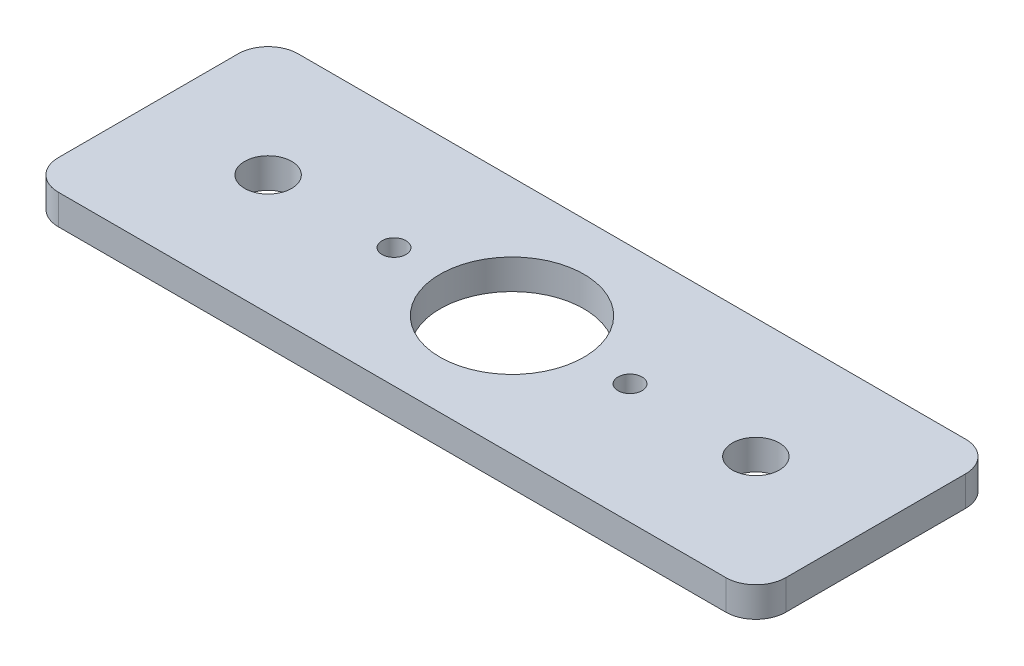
from build123d import *

# Parameters (mm, degrees)
SKETCH1_W           = 77.0636
SKETCH1_H           = 25.4
SKETCH1_R           = 7.62
SKETCH1_R_2         = 1.27
SKETCH1_R_3         = 2.4892
BOSS_EXTRUDE1_DEPTH = 3.175
FILLET1_R           = 3.175


with BuildPart() as part:
    # Sketch1 → Boss-Extrude1 (new body)
    with BuildSketch(Plane(origin=(0, 0, 0), x_dir=(1, 0, 0), z_dir=(0, 1, 0))):
        with Locations((38.5318, 12.7)):
            Rectangle(SKETCH1_W, SKETCH1_H)
        with Locations(Location((38.5318, 12.7, 0), (0, 0, 270))):
            Circle(SKETCH1_R, mode=Mode.SUBTRACT)
        with Locations(Location((51.0318, 12.7, 0), (0, 0, 270))):
            Circle(SKETCH1_R_2, mode=Mode.SUBTRACT)
        with Locations(Location((26.0318, 12.7, 0), (0, 0, 270))):
            Circle(SKETCH1_R_2, mode=Mode.SUBTRACT)
        with Locations(Location((64.3636, 12.7, 0), (0, 0, 270))):
            Circle(SKETCH1_R_3, mode=Mode.SUBTRACT)
        with Locations(Location((12.7, 12.7, 0), (0, 0, 270))):
            Circle(SKETCH1_R_3, mode=Mode.SUBTRACT)
    extrude(amount=BOSS_EXTRUDE1_DEPTH)

    # Fillet1
    fillet1_edges = [part.edges().sort_by_distance(p)[0] for p in [
        (0, 1.5875, -25.4),
        (77.0636, 1.5875, -25.4),
        (77.0636, 1.5875, 0),
        (0, 1.5875, 0),
    ]]
    fillet(fillet1_edges, radius=FILLET1_R)


solid = part.part
